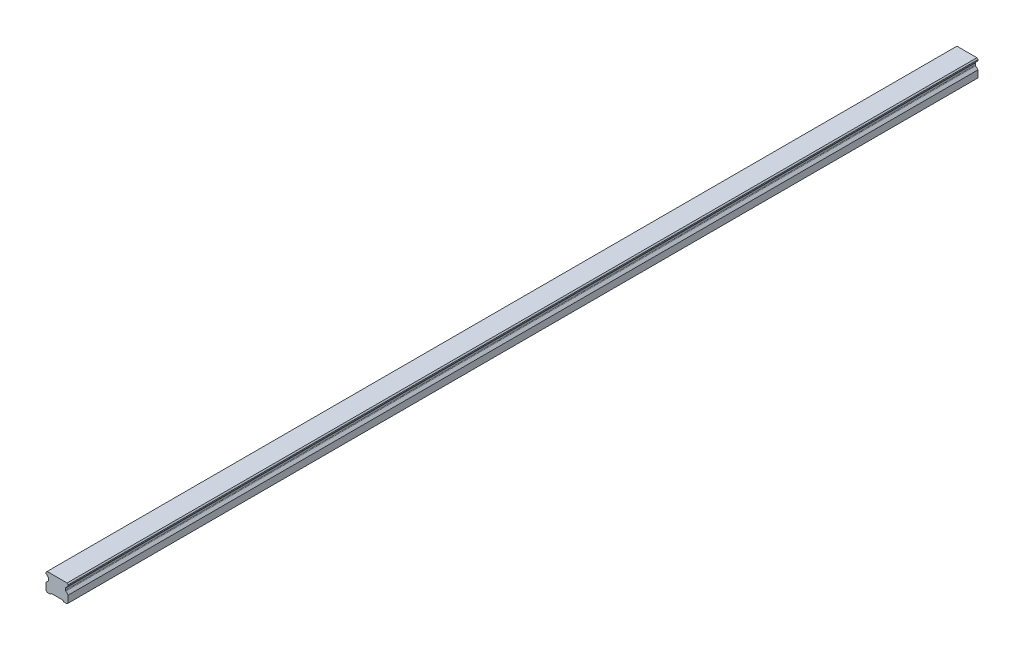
from build123d import *

# Parameters (mm, degrees)
SKETCH1_W           = 20
SKETCH1_H           = 16.3
BOSS_EXTRUDE1_DEPTH = 410
CUT_EXTRUDE1_DEPTH  = 821.222951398
CHAMFER1_SIZE       = 1
FILLET1_R           = 1
CUT_EXTRUDE2_DEPTH  = 821.222951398
SKETCH5_R           = 3
SKETCH5_R_2         = 2.5
CUT_EXTRUDE5_DEPTH  = 10
SKETCH5_2_R         = 2.5
CUT_EXTRUDE6_DEPTH  = 13
LPATTERN2_COUNT     = 14
LPATTERN2_PITCH     = 60


with BuildPart() as part:
    # Sketch1 → Boss-Extrude1 (new, symmetric)
    with BuildSketch(Plane.XY):
        with Locations((0, 8.15)):
            Rectangle(SKETCH1_W, SKETCH1_H)
    extrude(amount=BOSS_EXTRUDE1_DEPTH, both=True)

    # Sketch2 → Cut-Extrude1 (cut, through all)
    with BuildSketch(Plane.XY.offset(410)):
        Polygon((-10, 14.3), (-10, 7.3), (-7.666666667, 9.633333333), (-7.666666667, 11.966666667), align=None)
        Polygon((7.666666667, 11.966666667), (10, 14.3), (10, 7.3), (7.666666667, 9.633333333), align=None)
    extrude(amount=-CUT_EXTRUDE1_DEPTH, mode=Mode.SUBTRACT)

    # Chamfer1
    chamfer1_edges = [part.edges().sort_by_distance(p)[0] for p in [
        (-10, 16.3, 0),
        (10, 16.3, 0),
        (10, 0, 0),
        (-10, 0, 0),
    ]]
    chamfer(chamfer1_edges, length=CHAMFER1_SIZE)

    # Fillet1
    fillet1_edges = [part.edges().sort_by_distance(p)[0] for p in [
        (-7.666666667, 11.966666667, 0),
        (-7.666666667, 9.633333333, 0),
        (7.666666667, 9.633333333, 0),
        (7.666666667, 11.966666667, 0),
    ]]
    fillet(fillet1_edges, radius=FILLET1_R)

    # Sketch3 → Cut-Extrude2 (cut, through all)
    with BuildSketch(Plane.XY.offset(410)):
        Polygon((-6, 0), (-5, 1), (5, 1), (6, 0), align=None)
    extrude(amount=-CUT_EXTRUDE2_DEPTH, mode=Mode.SUBTRACT)

    # Sketch5 → Cut-Extrude5 (cut)
    with BuildSketch(Plane.XZ.offset(-1)):
        with Locations(Location((0, 390, 0), (0, 0, 270))):
            Circle(SKETCH5_R)
        with Locations(Location((0, 390, 0), (0, 0, 270))):
            Circle(SKETCH5_R_2, mode=Mode.SUBTRACT)
    cut_extrude5 = extrude(amount=-CUT_EXTRUDE5_DEPTH, mode=Mode.SUBTRACT)

    # Sketch5_2 → Cut-Extrude6 (cut)
    with BuildSketch(Plane.XZ.offset(-1)):
        with Locations(Location((0, 390, 0), (0, 0, 270))):
            Circle(SKETCH5_2_R)
    cut_extrude6 = extrude(amount=-CUT_EXTRUDE6_DEPTH, mode=Mode.SUBTRACT)

    # Cut-Extrude7 cone 1 section (on through the dimple's axis) → Cut-Extrude7 (revolve, cut)
    with BuildSketch(Plane(origin=(0, 14, 390), x_dir=(0, 0, -1), z_dir=(1, 0, 0))):
        Polygon((0, 0), (2.5, 0), (0, 1.443375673), align=None)
    cut_extrude7 = revolve(axis=Axis((0, 14, 390), (0, 1, 0)), mode=Mode.SUBTRACT)

    # LPattern2: Cut-Extrude5, Cut-Extrude6, Cut-Extrude7 ×14
    with Locations(*[(0, 0, -i * LPATTERN2_PITCH) for i in range(1, LPATTERN2_COUNT)]):
        add(cut_extrude5, mode=Mode.SUBTRACT)
        add(cut_extrude6, mode=Mode.SUBTRACT)
        add(cut_extrude7, mode=Mode.SUBTRACT)


solid = part.part
